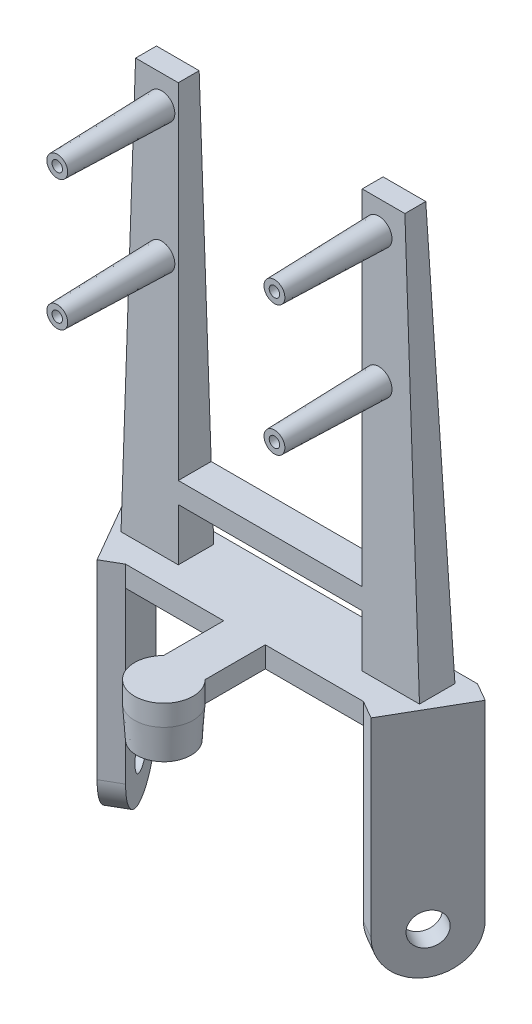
from build123d import *

# Parameters (mm, degrees)
BOSS_EXTRUDE1_DEPTH       = 2
BOSS_EXTRUDE2_DEPTH       = 2
SKETCH11_R                = 1.55
CUT_EXTRUDE1_DEPTH        = 2
SKETCH12_R                = 1.55
CUT_EXTRUDE2_DEPTH        = 2
BOSS_EXTRUDE4_DEPTH       = 2
BOSS_EXTRUDE7_DEPTH       = 40
DRAFT2_ANGLE              = 2
SKETCH19_R                = 1
BOSS_EXTRUDE8_DEPTH       = 10
SKETCH20_R                = 0.5
CUT_EXTRUDE3_DEPTH        = 5
DRAFT2_OF_MIRROR1_2_ANGLE = 2
DRAFT3_ANGLE              = 1.5
DRAFT4_ANGLE              = 1.5
DRAFT5_ANGLE              = 1.5
DRAFT6_ANGLE              = 1.5
CUT_EXTRUDE4_DEPTH        = 40
BOSS_EXTRUDE10_DEPTH      = 18


with BuildPart() as part:
    # Sketch8 → Boss-Extrude1 (new body)
    with BuildSketch(Plane(origin=(0, 0, 0), x_dir=(0.5000000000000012, 0, 0.8660254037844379), z_dir=(-0.8660254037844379, 0, 0.5000000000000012))):
        with BuildLine():
            Line((-30.783, 0), (-30.783, 16.25))
            Line((-30.783, 16.25), (-22.783, 16.25))
            Line((-22.783, 16.25), (-22.783, 0))
            ThreePointArc((-22.783, 0), (-26.783, -4), (-30.783, 0))
        make_face()
    extrude(amount=BOSS_EXTRUDE1_DEPTH)

    # Sketch12 → Cut-Extrude2 (cut)
    with BuildSketch(Plane(origin=(0, 0, 0), x_dir=(-0.5000000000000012, 0, -0.866025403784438), z_dir=(0.866025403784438, 0, -0.5000000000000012))):
        with Locations((26.783, 0)):
            Circle(SKETCH12_R)
    extrude(amount=-CUT_EXTRUDE2_DEPTH, mode=Mode.SUBTRACT)



with BuildPart() as body_2:
    # Sketch10 → Boss-Extrude2 (new body)
    with BuildSketch(Plane(origin=(0, 0, 0), x_dir=(0.500000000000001, 0, -0.866025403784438), z_dir=(0.866025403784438, 0, 0.500000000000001))):
        with BuildLine():
            Line((22.783, 0), (22.783, 16.25))
            Line((22.783, 16.25), (30.783, 16.25))
            Line((30.783, 16.25), (30.783, 0))
            ThreePointArc((30.783, 0), (26.783, -4), (22.783, 0))
        make_face()
    extrude(amount=BOSS_EXTRUDE2_DEPTH)

    # Sketch11 → Cut-Extrude1 (cut)
    with BuildSketch(Plane(origin=(0, 0, 0), x_dir=(-0.500000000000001, 0, 0.8660254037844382), z_dir=(-0.8660254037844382, 0, -0.500000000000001))):
        with Locations((-26.783, 0)):
            Circle(SKETCH11_R)
    extrude(amount=-CUT_EXTRUDE1_DEPTH, mode=Mode.SUBTRACT)


with BuildPart() as part_1:
    add(part.part)

    add(body_2.part)  # Boss-Extrude4 merges body 2
    # Sketch13 → Boss-Extrude4 (add)
    with BuildSketch(Plane(origin=(0, 16.25, 0), x_dir=(1, 0, 0), z_dir=(0, 1, 0))):
        with BuildLine():
            Line((-17.123550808, 25.658860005), (-15.3915, 26.658860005))
            Line((-15.3915, 26.658860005), (15.3915, 26.658860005))
            Line((15.3915, 26.658860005), (17.123550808, 25.658860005))
            Line((17.123550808, 25.658860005), (13.123550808, 18.730656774))
            Line((13.123550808, 18.730656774), (11.3915, 19.730656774))
            Line((11.3915, 19.730656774), (1.994081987, 19.730656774))
            Line((1.994081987, 19.730656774), (1.994081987, 13.965613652))
            ThreePointArc((1.994081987, 13.965613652), (0, 9.2), (-1.994081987, 13.965613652))
            Line((-1.994081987, 13.965613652), (-1.994081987, 19.730656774))
            Line((-1.994081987, 19.730656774), (-11.3915, 19.730656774))
            Line((-11.3915, 19.730656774), (-13.123550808, 18.730656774))
            Line((-13.123550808, 18.730656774), (-17.123550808, 25.658860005))
        make_face()
    extrude(amount=BOSS_EXTRUDE4_DEPTH)

    # Sketch14 → Revolve1 (revolve)
    with BuildSketch(Plane(origin=(0, 0, 0), x_dir=(0, 0, -1), z_dir=(1, 0, 0))):
        Polygon((9.2, 16.25), (12, 16.25), (12, 13.25), (9.4, 13.25), align=None)
    revolve(axis=Axis((0, 16.25, -12), (0, -1, 0)))

    # Sketch15 → Boss-Extrude7 (add)
    with BuildSketch(Plane(origin=(0, 18.25, 0), x_dir=(1, 0, 0), z_dir=(0, 1, 0))):
        Polygon((-12.899224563, 23.19475839), (-12.899224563, 24.19475839), (-7.904492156, 24.19475839), (-7.904492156, 22.19475839), (-12.899224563, 22.19475839), align=None)
    boss_extrude7 = extrude(amount=BOSS_EXTRUDE7_DEPTH)

    # Draft2
    draft2_faces = [part_1.faces().sort_by_distance(p)[0] for p in [
        (-10.401858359, 38.25, -24.19475839),
        (-12.899224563, 38.25, -23.19475839),
    ]]
    draft(draft2_faces, Plane.ZX.offset(58.25), DRAFT2_ANGLE)

    # Sketch19 → Boss-Extrude8 (add)
    with BuildSketch(Plane.XY.offset(-22.19475839)):
        with Locations(Location((-10.401858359, 55.524846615, 0), (0, 0, 180))):
            Circle(SKETCH19_R)
        with Locations(Location((-10.401858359, 43.05, 0), (0, 0, 180))):
            Circle(SKETCH19_R)
    boss_extrude8 = extrude(amount=BOSS_EXTRUDE8_DEPTH)

    # Sketch20 → Cut-Extrude3 (cut)
    with BuildSketch(Plane.XY.offset(-12.19475839)):
        with Locations((-10.401858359, 55.524846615)):
            Circle(SKETCH20_R)
        with Locations((-10.401858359, 43.05)):
            Circle(SKETCH20_R)
    cut_extrude3 = extrude(amount=-CUT_EXTRUDE3_DEPTH, mode=Mode.SUBTRACT)

    # Mirror1: Boss-Extrude7, Boss-Extrude8, Cut-Extrude3 across plane
    add(boss_extrude7.mirror(Plane(origin=(0, 0, 0), x_dir=(0, 0, 1), z_dir=(1, 0, 0))))
    add(boss_extrude8.mirror(Plane(origin=(0, 0, 0), x_dir=(0, 0, 1), z_dir=(1, 0, 0))))
    add(cut_extrude3.mirror(Plane(origin=(0, 0, 0), x_dir=(0, 0, 1), z_dir=(1, 0, 0))), mode=Mode.SUBTRACT)

    # Draft2 of Mirror1 2
    draft2_of_mirror1_2_faces = [part_1.faces().sort_by_distance(p)[0] for p in [
        (10.401858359, 38.25, -24.19475839),
        (12.899224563, 38.25, -23.19475839),
    ]]
    draft(draft2_of_mirror1_2_faces, Plane.ZX.offset(58.25), DRAFT2_OF_MIRROR1_2_ANGLE)

    # Draft3
    draft3_faces = [part_1.faces().sort_by_distance(p)[0] for p in [
        (-9.401858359, 55.524846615, -17.19475839),
    ]]
    draft(draft3_faces, Plane(origin=(-10.401858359, 55.524846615, -12.19475839), x_dir=(1, 0, 0), z_dir=(0, 0, 1)), DRAFT3_ANGLE)

    # Draft4
    draft4_faces = [part_1.faces().sort_by_distance(p)[0] for p in [
        (9.401858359, 55.524846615, -17.19475839),
    ]]
    draft(draft4_faces, Plane(origin=(10.401858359, 55.524846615, -12.19475839), x_dir=(1, 0, 0), z_dir=(0, 0, 1)), DRAFT4_ANGLE)

    # Draft5
    draft5_faces = [part_1.faces().sort_by_distance(p)[0] for p in [
        (-9.401858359, 43.05, -17.19475839),
    ]]
    draft(draft5_faces, Plane(origin=(-10.401858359, 43.05, -12.19475839), x_dir=(1, 0, 0), z_dir=(0, 0, 1)), DRAFT5_ANGLE)

    # Draft6
    draft6_faces = [part_1.faces().sort_by_distance(p)[0] for p in [
        (9.401858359, 43.05, -17.19475839),
    ]]
    draft(draft6_faces, Plane(origin=(10.401858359, 43.05, -12.19475839), x_dir=(1, 0, 0), z_dir=(0, 0, 1)), DRAFT6_ANGLE)

    # Sketch24 → Cut-Extrude4 (cut)
    with BuildSketch(Plane(origin=(0, 58.25, 0), x_dir=(1, 0, 0), z_dir=(0, 1, 0))):
        Polygon((-8.809375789, 24.19475839), (-8.809375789, 22.19475839), (-7.904492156, 22.19475839), (-7.904492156, 25.591589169), (-8.809375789, 25.591589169), align=None)
    cut_extrude4 = extrude(amount=-CUT_EXTRUDE4_DEPTH, mode=Mode.SUBTRACT)

    # Mirror2: Cut-Extrude4 across plane
    add(cut_extrude4.mirror(Plane(origin=(0, 0, 0), x_dir=(0, 0, 1), z_dir=(1, 0, 0))), mode=Mode.SUBTRACT)

    # Sketch25 → Boss-Extrude10 (add)
    with BuildSketch(Plane(origin=(-8.809375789, 0, 0), x_dir=(0, 0, -1), z_dir=(1, 0, 0))):
        Polygon((22.19475839, 23.25), (25.416985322, 23.25), (25.347212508, 25.248031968), (22.19475839, 25.248031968), align=None)
    extrude(amount=BOSS_EXTRUDE10_DEPTH)


solid = part_1.part
